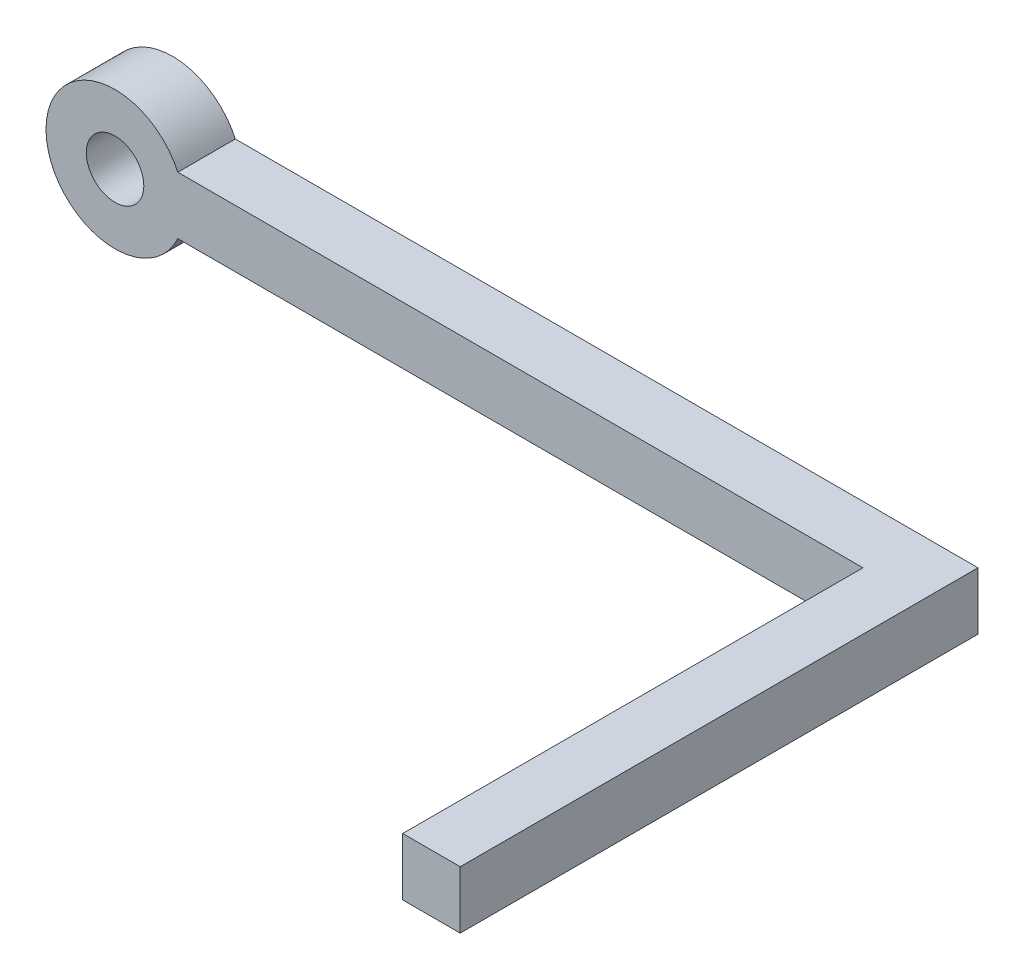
from build123d import *

# Parameters (mm, degrees)
SKETCH3_R           = 3.81
BOSS_EXTRUDE2_DEPTH = 3.175
BOSS_EXTRUDE3_DEPTH = 3.175
SKETCH6_R           = 1.5875
CUT_EXTRUDE1_DEPTH  = 3.175
SKETCH8_W           = 3.175
SKETCH8_H           = 3.175
BOSS_EXTRUDE5_DEPTH = 25.4


with BuildPart() as part:
    # Sketch3 → Boss-Extrude2 (new body)
    with BuildSketch(Plane.XY):
        Circle(SKETCH3_R)
    extrude(amount=BOSS_EXTRUDE2_DEPTH)

    # Sketch5 → Boss-Extrude3 (add)
    with BuildSketch(Plane.XY.offset(3.175)):
        Polygon((0, 0), (0, 1.5875), (44.45, 1.5875), (44.45, -1.5875), (0, -1.5875), align=None)
    extrude(amount=-BOSS_EXTRUDE3_DEPTH)

    # Sketch6 → Cut-Extrude1 (cut)
    with BuildSketch(Plane.XY.offset(3.175)):
        Circle(SKETCH6_R)
    extrude(amount=-CUT_EXTRUDE1_DEPTH, mode=Mode.SUBTRACT)

    # Sketch8 → Boss-Extrude5 (add)
    with BuildSketch(Plane.XY.offset(3.175)):
        with Locations((42.8625, 0)):
            Rectangle(SKETCH8_W, SKETCH8_H)
    extrude(amount=BOSS_EXTRUDE5_DEPTH)


solid = part.part
